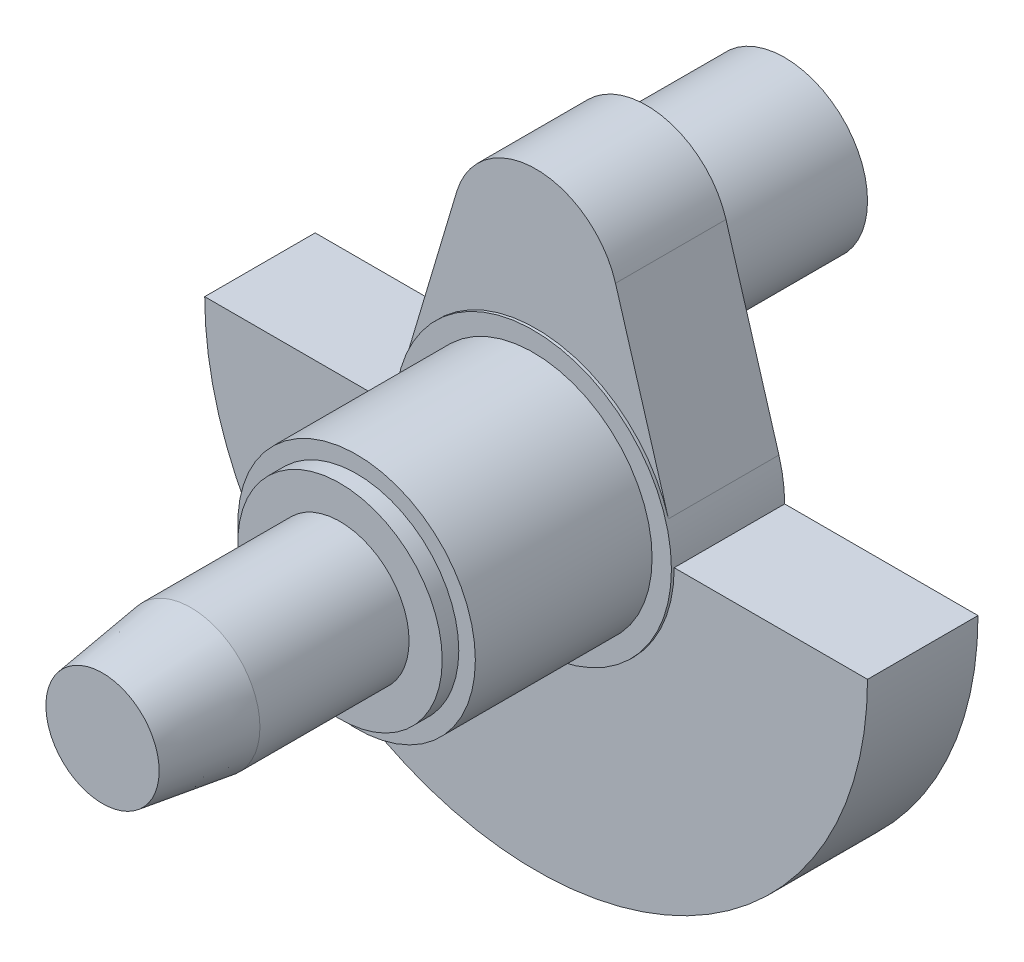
from build123d import *

# Parameters (mm, degrees)
BOSS_EXTRUDE1_DEPTH      = 1
BOSS_EXTRUDE1_DEPTH_BACK = 40
SKETCH1_R                = 50
BOSS_EXTRUDE2_DEPTH      = 40
SKETCH3_R                = 25
BOSS_EXTRUDE3_DEPTH      = 32
BOSS_EXTRUDE3_TAPER      = 8
SKETCH4_R                = 30
BOSS_EXTRUDE4_DEPTH      = 50


with BuildPart() as part:
    # Sketch1 → Boss-Extrude1 (new, two sides: drawn at the far end of the back side and taken through both)
    with BuildSketch(Plane.XY.offset(-BOSS_EXTRUDE1_DEPTH_BACK)):
        Circle(SKETCH1_R)
    extrude(amount=BOSS_EXTRUDE1_DEPTH + BOSS_EXTRUDE1_DEPTH_BACK)

    # Sketch1_3 → Boss-Extrude2 (add)
    with BuildSketch(Plane.XY):
        with BuildLine():
            ThreePointArc((50, 0), (0, -50), (-50, 0))
            Line((-50, 0), (-120, 0))
            ThreePointArc((-120, 0), (0, -120), (120, 0))
            Line((120, 0), (50, 0))
        make_face()
        with BuildLine():
            ThreePointArc((28.749445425, 78.571428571), (0, 100), (-28.749445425, 78.571428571))
            Line((-28.749445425, 78.571428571), (-47.915742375, 14.285714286))
            ThreePointArc((-47.915742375, 14.285714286), (0, 50), (47.915742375, 14.285714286))
            Line((47.915742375, 14.285714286), (28.749445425, 78.571428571))
        make_face()
    extrude(amount=-BOSS_EXTRUDE2_DEPTH)

    # Sketch2 → Revolve1 (revolve)
    with BuildSketch(Plane(origin=(0, 0, 0), x_dir=(0, 0, -1), z_dir=(1, 0, 0)), mode=Mode.PRIVATE) as revolve1_sk:
        Polygon((-1, 0), (-1, 43), (-65, 43), (-65, 37), (-71, 37), (-71, 25), (-125, 25), (-125, 0), align=None)
    revolve(revolve1_sk.sketch.rotate(Axis((0, 0, 125), (0, 0, -1)), 90), axis=Axis((0, 0, 125), (0, 0, -1)))

    # Sketch3 → Boss-Extrude3 (add)
    with BuildSketch(Plane.XY.offset(125)):
        Circle(SKETCH3_R)
    extrude(amount=BOSS_EXTRUDE3_DEPTH, taper=BOSS_EXTRUDE3_TAPER)

    # Sketch4 → Boss-Extrude4 (add)
    with BuildSketch(Plane(origin=(0, 0, -40), x_dir=(-1, 0, 0), z_dir=(0, 0, -1))):
        with Locations(Location((0, 60, 0), (0, 0, 180))):
            Circle(SKETCH4_R)
    extrude(amount=BOSS_EXTRUDE4_DEPTH)


solid = part.part
